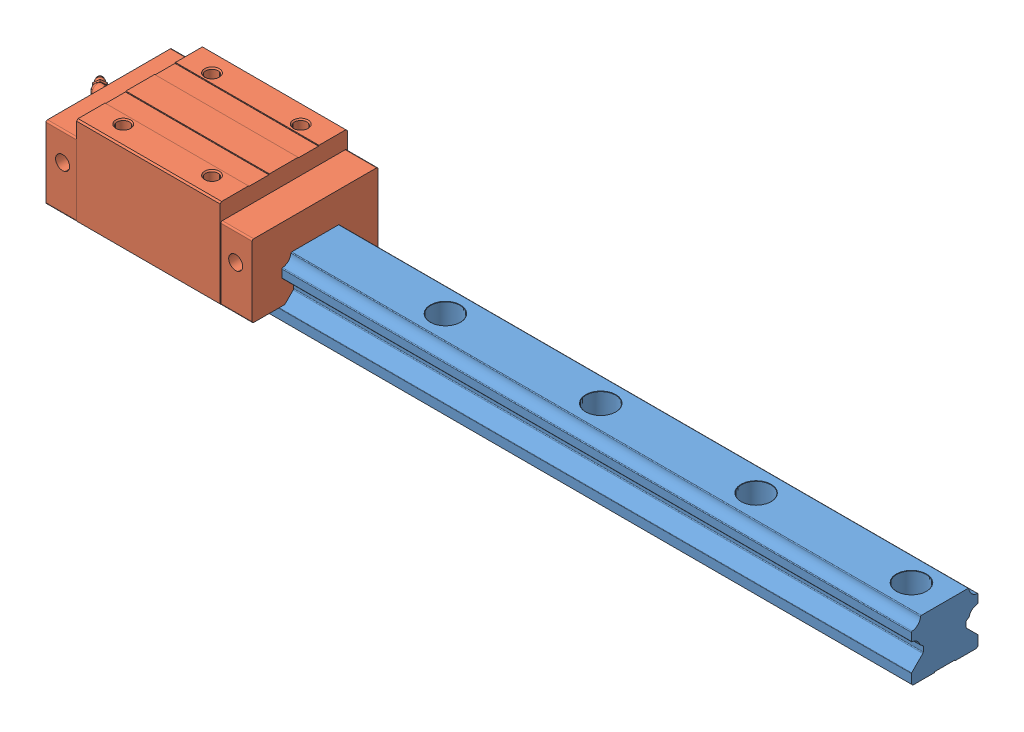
SolidWorks assembly HLH45CA.stp.sldasm, configuration 默认 (file format 13000). Lengths in mm.
Overall size (579.43 70 86).
2 component instances, 2 part files, 0 mates.
Components (placement in the parent):
- HLR45R570 E=22.5-1: HLR45R570 E=22.5.SLDPRT [默认] at origin size (570 38 45)
- HLH45CA-1: HLH45CA.SLDPRT [默认] at (5 9.5 0) size (153.83 60.5 86)
